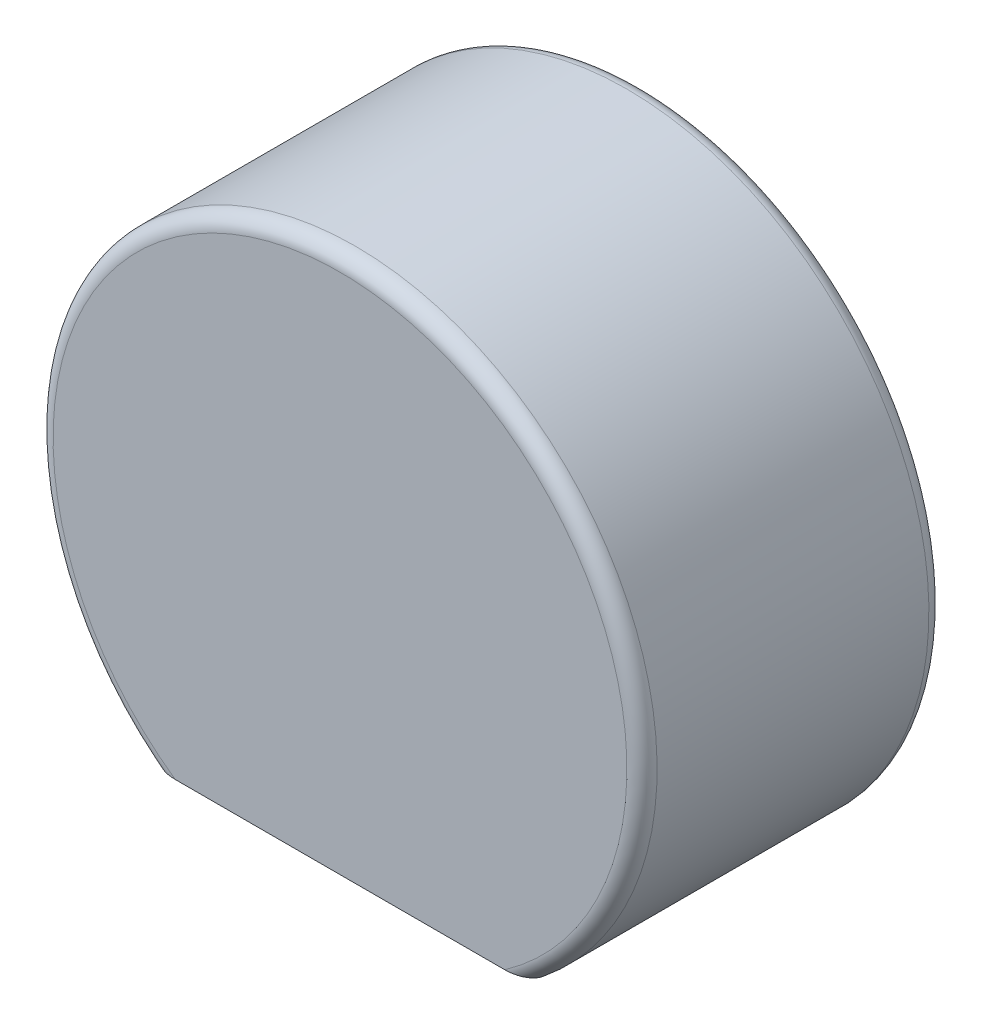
ISO-10303-21;
HEADER;
FILE_DESCRIPTION(('STEP AP214'),'2;1');
FILE_NAME('part.step','',(''),(''),'','','');
FILE_SCHEMA(('AUTOMOTIVE_DESIGN { 1 0 10303 214 1 1 1 1 }'));
ENDSEC;
DATA;
#1=APPLICATION_CONTEXT('core data for automotive mechanical design processes');
#2=APPLICATION_PROTOCOL_DEFINITION('international standard','automotive_design',2000,#1);
#3=PRODUCT_CONTEXT('',#1,'mechanical');
#4=PRODUCT('Part','Part','',(#3));
#5=PRODUCT_RELATED_PRODUCT_CATEGORY('part','',(#4));
#6=PRODUCT_DEFINITION_FORMATION('','',#4);
#7=PRODUCT_DEFINITION_CONTEXT('part definition',#1,'design');
#8=PRODUCT_DEFINITION('design','',#6,#7);
#9=PRODUCT_DEFINITION_SHAPE('','',#8);
#10=(LENGTH_UNIT() NAMED_UNIT(*) SI_UNIT(.MILLI.,.METRE.));
#11=(NAMED_UNIT(*) PLANE_ANGLE_UNIT() SI_UNIT($,.RADIAN.));
#12=(NAMED_UNIT(*) SI_UNIT($,.STERADIAN.) SOLID_ANGLE_UNIT());
#13=UNCERTAINTY_MEASURE_WITH_UNIT(LENGTH_MEASURE(1.E-05),#10,'distance_accuracy_value','');
#14=(GEOMETRIC_REPRESENTATION_CONTEXT(3) GLOBAL_UNCERTAINTY_ASSIGNED_CONTEXT((#13)) GLOBAL_UNIT_ASSIGNED_CONTEXT((#10,
#11,#12)) REPRESENTATION_CONTEXT('',''));
#15=CARTESIAN_POINT('',(0.,0.,0.));
#16=DIRECTION('',(0.,0.,1.));
#17=DIRECTION('',(1.,0.,0.));
#18=AXIS2_PLACEMENT_3D('',#15,#16,#17);
#19=CARTESIAN_POINT('',(0.,0.,20.));
#20=DIRECTION('',(0.,0.,-1.));
#21=DIRECTION('',(-1.,0.,0.));
#22=AXIS2_PLACEMENT_3D('',#19,#20,#21);
#23=CYLINDRICAL_SURFACE('',#22,20.);
#24=DIRECTION('',(0.,0.,-1.));
#25=VECTOR('',#24,1.);
#26=CARTESIAN_POINT('',(12.5707872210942,-15.5555555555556,20.));
#27=LINE('',#26,#25);
#28=CARTESIAN_POINT('',(12.5707872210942,-15.5555555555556,19.));
#29=VERTEX_POINT('',#28);
#30=CARTESIAN_POINT('',(12.5707872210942,-15.5555555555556,1.));
#31=VERTEX_POINT('',#30);
#32=EDGE_CURVE('E96',#29,#31,#27,.T.);
#33=ORIENTED_EDGE('',*,*,#32,.T.);
#34=CARTESIAN_POINT('',(0.,0.,1.));
#35=DIRECTION('',(0.,0.,1.));
#36=DIRECTION('',(1.,0.,0.));
#37=AXIS2_PLACEMENT_3D('',#34,#35,#36);
#38=CIRCLE('',#37,20.);
#39=CARTESIAN_POINT('',(-12.5707872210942,-15.5555555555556,1.));
#40=VERTEX_POINT('',#39);
#41=EDGE_CURVE('E94',#31,#40,#38,.T.);
#42=ORIENTED_EDGE('',*,*,#41,.T.);
#43=DIRECTION('',(0.,0.,-1.));
#44=VECTOR('',#43,1.);
#45=CARTESIAN_POINT('',(-12.5707872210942,-15.5555555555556,20.));
#46=LINE('',#45,#44);
#47=CARTESIAN_POINT('',(-12.5707872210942,-15.5555555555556,19.));
#48=VERTEX_POINT('',#47);
#49=EDGE_CURVE('E84',#48,#40,#46,.T.);
#50=ORIENTED_EDGE('',*,*,#49,.F.);
#51=CARTESIAN_POINT('',(0.,0.,19.));
#52=DIRECTION('',(0.,0.,1.));
#53=DIRECTION('',(1.,0.,0.));
#54=AXIS2_PLACEMENT_3D('',#51,#52,#53);
#55=CIRCLE('',#54,20.);
#56=EDGE_CURVE('E92',#48,#29,#55,.F.);
#57=ORIENTED_EDGE('',*,*,#56,.T.);
#58=EDGE_LOOP('',(#33,#42,#50,#57));
#59=FACE_BOUND('',#58,.T.);
#60=ADVANCED_FACE('F39',(#59),#23,.T.);
#61=CARTESIAN_POINT('',(-12.5707872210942,-15.5555555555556,20.));
#62=DIRECTION('',(0.,1.,0.));
#63=DIRECTION('',(0.,0.,1.));
#64=AXIS2_PLACEMENT_3D('',#61,#62,#63);
#65=PLANE('',#64);
#66=ORIENTED_EDGE('',*,*,#49,.T.);
#67=CARTESIAN_POINT('',(-12.5707872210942,-15.5555555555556,1.));
#68=CARTESIAN_POINT('',(-12.5707926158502,-15.5555555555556,0.979078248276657));
#69=CARTESIAN_POINT('',(-12.5697416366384,-15.5555555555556,0.958170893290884));
#70=CARTESIAN_POINT('',(-12.5655868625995,-15.5555555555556,0.916582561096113));
#71=CARTESIAN_POINT('',(-12.5624852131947,-15.5555555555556,0.89590137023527));
#72=CARTESIAN_POINT('',(-12.5502839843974,-15.5555555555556,0.834894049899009));
#73=CARTESIAN_POINT('',(-12.5382850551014,-15.5555555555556,0.795120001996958));
#74=CARTESIAN_POINT('',(-12.5076434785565,-15.5555555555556,0.718478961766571));
#75=CARTESIAN_POINT('',(-12.4890263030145,-15.5555555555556,0.681601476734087));
#76=CARTESIAN_POINT('',(-12.4463729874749,-15.5555555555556,0.611039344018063));
#77=CARTESIAN_POINT('',(-12.4223215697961,-15.5555555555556,0.577364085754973));
#78=CARTESIAN_POINT('',(-12.3571153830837,-15.5555555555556,0.497734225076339));
#79=CARTESIAN_POINT('',(-12.313372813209,-15.5555555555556,0.453905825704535));
#80=CARTESIAN_POINT('',(-12.2196095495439,-15.5555555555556,0.373653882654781));
#81=CARTESIAN_POINT('',(-12.169577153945,-15.5555555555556,0.337244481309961));
#82=CARTESIAN_POINT('',(-12.0360932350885,-15.5555555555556,0.252565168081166));
#83=CARTESIAN_POINT('',(-11.9496241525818,-15.5555555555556,0.209080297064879));
#84=CARTESIAN_POINT('',(-11.77096505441,-15.5555555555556,0.135606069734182));
#85=CARTESIAN_POINT('',(-11.6787527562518,-15.5555555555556,0.105673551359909));
#86=CARTESIAN_POINT('',(-11.5296946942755,-15.5555555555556,0.0673312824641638));
#87=CARTESIAN_POINT('',(-11.473781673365,-15.5555555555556,0.055123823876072));
#88=CARTESIAN_POINT('',(-11.361238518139,-15.5555555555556,0.0344879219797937));
#89=CARTESIAN_POINT('',(-11.3046081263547,-15.5555555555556,0.0260608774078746));
#90=CARTESIAN_POINT('',(-11.1916824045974,-15.5555555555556,0.012831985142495));
#91=CARTESIAN_POINT('',(-11.1353923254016,-15.5555555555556,0.00798432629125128));
#92=CARTESIAN_POINT('',(-11.0226796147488,-15.5555555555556,0.00157460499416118));
#93=CARTESIAN_POINT('',(-10.9662571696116,-15.5555555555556,9.29559272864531E-06));
#94=CARTESIAN_POINT('',(-10.9098437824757,-15.5555555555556,0.));
#95=B_SPLINE_CURVE_WITH_KNOTS('',3,(#67,#68,#69,#70,#71,#72,#73,#74,#75,#76,#77,#78,#79,#80,#81,
#82,#83,#84,#85,#86,#87,#88,#89,#90,#91,#92,#93,#94),.UNSPECIFIED.,.F.,.F.,(4,2,2,2,2,2,2,2,2,2,
2,2,2,4),(0.,0.0627120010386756,0.125358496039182,0.249223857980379,0.372617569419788,
0.496362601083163,0.681085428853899,0.86615715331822,1.15492622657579,1.44489541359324,
1.61646808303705,1.78810418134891,1.95750357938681,2.12673532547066),.UNSPECIFIED.);
#96=CARTESIAN_POINT('',(-10.9098437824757,-15.5555555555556,0.));
#97=VERTEX_POINT('',#96);
#98=EDGE_CURVE('E131',#40,#97,#95,.T.);
#99=ORIENTED_EDGE('',*,*,#98,.T.);
#100=DIRECTION('',(1.,0.,0.));
#101=VECTOR('',#100,1.);
#102=CARTESIAN_POINT('',(-12.5707872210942,-15.5555555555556,0.));
#103=LINE('',#102,#101);
#104=CARTESIAN_POINT('',(10.9098437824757,-15.5555555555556,0.));
#105=VERTEX_POINT('',#104);
#106=EDGE_CURVE('E185',#97,#105,#103,.T.);
#107=ORIENTED_EDGE('',*,*,#106,.T.);
#108=CARTESIAN_POINT('',(10.9098437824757,-15.5555555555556,0.));
#109=CARTESIAN_POINT('',(10.9886129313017,-15.5555555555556,3.68574071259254E-05));
#110=CARTESIAN_POINT('',(11.0674309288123,-15.5555555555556,0.00307258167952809));
#111=CARTESIAN_POINT('',(11.2248978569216,-15.5555555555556,0.0156951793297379));
#112=CARTESIAN_POINT('',(11.3035443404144,-15.5555555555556,0.0253121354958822));
#113=CARTESIAN_POINT('',(11.4604832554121,-15.5555555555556,0.0517982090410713));
#114=CARTESIAN_POINT('',(11.5387633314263,-15.5555555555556,0.0687422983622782));
#115=CARTESIAN_POINT('',(11.6929999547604,-15.5555555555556,0.110718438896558));
#116=CARTESIAN_POINT('',(11.7689611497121,-15.5555555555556,0.135732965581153));
#117=CARTESIAN_POINT('',(11.9047058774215,-15.5555555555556,0.190000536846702));
#118=CARTESIAN_POINT('',(11.9650550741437,-15.5555555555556,0.217824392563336));
#119=CARTESIAN_POINT('',(12.0819167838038,-15.5555555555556,0.280714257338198));
#120=CARTESIAN_POINT('',(12.1384303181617,-15.5555555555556,0.315778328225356));
#121=CARTESIAN_POINT('',(12.2464099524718,-15.5555555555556,0.394671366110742));
#122=CARTESIAN_POINT('',(12.2977871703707,-15.5555555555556,0.438624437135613));
#123=CARTESIAN_POINT('',(12.3910082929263,-15.5555555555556,0.535701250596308));
#124=CARTESIAN_POINT('',(12.4328925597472,-15.5555555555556,0.588784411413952));
#125=CARTESIAN_POINT('',(12.4876151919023,-15.5555555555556,0.679240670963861));
#126=CARTESIAN_POINT('',(12.5052388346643,-15.5555555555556,0.713729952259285));
#127=CARTESIAN_POINT('',(12.5346803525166,-15.5555555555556,0.785079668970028));
#128=CARTESIAN_POINT('',(12.5465113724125,-15.5555555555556,0.82193451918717));
#129=CARTESIAN_POINT('',(12.560204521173,-15.5555555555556,0.882534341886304));
#130=CARTESIAN_POINT('',(12.5641532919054,-15.5555555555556,0.905821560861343));
#131=CARTESIAN_POINT('',(12.5694527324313,-15.5555555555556,0.952732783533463));
#132=CARTESIAN_POINT('',(12.5707985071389,-15.5555555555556,0.976357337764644));
#133=CARTESIAN_POINT('',(12.5707872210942,-15.5555555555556,1.));
#134=B_SPLINE_CURVE_WITH_KNOTS('',3,(#108,#109,#110,#111,#112,#113,#114,#115,#116,#117,#118,
#119,#120,#121,#122,#123,#124,#125,#126,#127,#128,#129,#130,#131,#132,#133),.UNSPECIFIED.,.F.,
.F.,(4,2,2,2,2,2,2,2,2,2,2,2,4),(0.,0.236325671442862,0.473738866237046,0.713641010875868,
0.953025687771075,1.15198379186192,1.35088870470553,1.55279060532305,1.75381724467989,
1.86959620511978,1.9851112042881,2.05583541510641,2.12669249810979),.UNSPECIFIED.);
#135=EDGE_CURVE('E87',#105,#31,#134,.T.);
#136=ORIENTED_EDGE('',*,*,#135,.T.);
#137=ORIENTED_EDGE('',*,*,#32,.F.);
#138=CARTESIAN_POINT('',(12.5707872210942,-15.5555555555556,19.));
#139=CARTESIAN_POINT('',(12.5707926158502,-15.5555555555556,19.0209217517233));
#140=CARTESIAN_POINT('',(12.5697416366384,-15.5555555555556,19.0418291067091));
#141=CARTESIAN_POINT('',(12.5655868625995,-15.5555555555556,19.0834174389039));
#142=CARTESIAN_POINT('',(12.5624852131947,-15.5555555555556,19.1040986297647));
#143=CARTESIAN_POINT('',(12.5502839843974,-15.5555555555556,19.165105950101));
#144=CARTESIAN_POINT('',(12.5382850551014,-15.5555555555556,19.204879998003));
#145=CARTESIAN_POINT('',(12.5076434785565,-15.5555555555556,19.2815210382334));
#146=CARTESIAN_POINT('',(12.4890263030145,-15.5555555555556,19.3183985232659));
#147=CARTESIAN_POINT('',(12.4463729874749,-15.5555555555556,19.3889606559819));
#148=CARTESIAN_POINT('',(12.4223215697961,-15.5555555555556,19.422635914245));
#149=CARTESIAN_POINT('',(12.3571153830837,-15.5555555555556,19.5022657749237));
#150=CARTESIAN_POINT('',(12.313372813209,-15.5555555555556,19.5460941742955));
#151=CARTESIAN_POINT('',(12.2196095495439,-15.5555555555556,19.6263461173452));
#152=CARTESIAN_POINT('',(12.169577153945,-15.5555555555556,19.66275551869));
#153=CARTESIAN_POINT('',(12.0360932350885,-15.5555555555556,19.7474348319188));
#154=CARTESIAN_POINT('',(11.9496241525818,-15.5555555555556,19.7909197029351));
#155=CARTESIAN_POINT('',(11.77096505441,-15.5555555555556,19.8643939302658));
#156=CARTESIAN_POINT('',(11.6787527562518,-15.5555555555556,19.8943264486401));
#157=CARTESIAN_POINT('',(11.5296946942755,-15.5555555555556,19.9326687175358));
#158=CARTESIAN_POINT('',(11.473781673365,-15.5555555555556,19.9448761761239));
#159=CARTESIAN_POINT('',(11.361238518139,-15.5555555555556,19.9655120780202));
#160=CARTESIAN_POINT('',(11.3046081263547,-15.5555555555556,19.9739391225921));
#161=CARTESIAN_POINT('',(11.1916824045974,-15.5555555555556,19.9871680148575));
#162=CARTESIAN_POINT('',(11.1353923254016,-15.5555555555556,19.9920156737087));
#163=CARTESIAN_POINT('',(11.0226796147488,-15.5555555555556,19.9984253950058));
#164=CARTESIAN_POINT('',(10.9662571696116,-15.5555555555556,19.9999907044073));
#165=CARTESIAN_POINT('',(10.9098437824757,-15.5555555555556,20.));
#166=B_SPLINE_CURVE_WITH_KNOTS('',3,(#138,#139,#140,#141,#142,#143,#144,#145,#146,#147,#148,
#149,#150,#151,#152,#153,#154,#155,#156,#157,#158,#159,#160,#161,#162,#163,#164,#165),
.UNSPECIFIED.,.F.,.F.,(4,2,2,2,2,2,2,2,2,2,2,2,2,4),(0.,0.0627120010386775,0.125358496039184,
0.249223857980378,0.372617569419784,0.496362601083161,0.681085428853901,0.866157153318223,
1.15492622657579,1.44489541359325,1.61646808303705,1.78810418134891,1.95750357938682,
2.12673532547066),.UNSPECIFIED.);
#167=CARTESIAN_POINT('',(10.9098437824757,-15.5555555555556,20.));
#168=VERTEX_POINT('',#167);
#169=EDGE_CURVE('E56',#29,#168,#166,.T.);
#170=ORIENTED_EDGE('',*,*,#169,.T.);
#171=DIRECTION('',(1.,0.,0.));
#172=VECTOR('',#171,1.);
#173=CARTESIAN_POINT('',(-12.5707872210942,-15.5555555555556,20.));
#174=LINE('',#173,#172);
#175=CARTESIAN_POINT('',(-10.9098437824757,-15.5555555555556,20.));
#176=VERTEX_POINT('',#175);
#177=EDGE_CURVE('E85',#176,#168,#174,.T.);
#178=ORIENTED_EDGE('',*,*,#177,.F.);
#179=CARTESIAN_POINT('',(-10.9098437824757,-15.5555555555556,20.));
#180=CARTESIAN_POINT('',(-10.9886129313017,-15.5555555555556,19.9999631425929));
#181=CARTESIAN_POINT('',(-11.0674309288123,-15.5555555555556,19.9969274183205));
#182=CARTESIAN_POINT('',(-11.2248978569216,-15.5555555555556,19.9843048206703));
#183=CARTESIAN_POINT('',(-11.3035443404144,-15.5555555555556,19.9746878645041));
#184=CARTESIAN_POINT('',(-11.4604832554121,-15.5555555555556,19.9482017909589));
#185=CARTESIAN_POINT('',(-11.5387633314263,-15.5555555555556,19.9312577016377));
#186=CARTESIAN_POINT('',(-11.6929999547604,-15.5555555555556,19.8892815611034));
#187=CARTESIAN_POINT('',(-11.7689611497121,-15.5555555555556,19.8642670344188));
#188=CARTESIAN_POINT('',(-11.9047058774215,-15.5555555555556,19.8099994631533));
#189=CARTESIAN_POINT('',(-11.9650550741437,-15.5555555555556,19.7821756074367));
#190=CARTESIAN_POINT('',(-12.0819167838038,-15.5555555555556,19.7192857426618));
#191=CARTESIAN_POINT('',(-12.1384303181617,-15.5555555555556,19.6842216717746));
#192=CARTESIAN_POINT('',(-12.2464099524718,-15.5555555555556,19.6053286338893));
#193=CARTESIAN_POINT('',(-12.2977871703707,-15.5555555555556,19.5613755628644));
#194=CARTESIAN_POINT('',(-12.3910082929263,-15.5555555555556,19.4642987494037));
#195=CARTESIAN_POINT('',(-12.4328925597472,-15.5555555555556,19.4112155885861));
#196=CARTESIAN_POINT('',(-12.4876151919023,-15.5555555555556,19.3207593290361));
#197=CARTESIAN_POINT('',(-12.5052388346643,-15.5555555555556,19.2862700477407));
#198=CARTESIAN_POINT('',(-12.5346803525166,-15.5555555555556,19.21492033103));
#199=CARTESIAN_POINT('',(-12.5465113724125,-15.5555555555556,19.1780654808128));
#200=CARTESIAN_POINT('',(-12.5602045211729,-15.5555555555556,19.1174656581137));
#201=CARTESIAN_POINT('',(-12.5641532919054,-15.5555555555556,19.0941784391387));
#202=CARTESIAN_POINT('',(-12.5694527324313,-15.5555555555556,19.0472672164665));
#203=CARTESIAN_POINT('',(-12.5707985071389,-15.5555555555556,19.0236426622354));
#204=CARTESIAN_POINT('',(-12.5707872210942,-15.5555555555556,19.));
#205=B_SPLINE_CURVE_WITH_KNOTS('',3,(#179,#180,#181,#182,#183,#184,#185,#186,#187,#188,#189,
#190,#191,#192,#193,#194,#195,#196,#197,#198,#199,#200,#201,#202,#203,#204),.UNSPECIFIED.,.F.,
.F.,(4,2,2,2,2,2,2,2,2,2,2,2,4),(0.,0.236325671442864,0.473738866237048,0.713641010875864,
0.953025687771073,1.15198379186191,1.35088870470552,1.55279060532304,1.75381724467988,
1.86959620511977,1.9851112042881,2.0558354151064,2.12669249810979),.UNSPECIFIED.);
#206=EDGE_CURVE('E64',#176,#48,#205,.T.);
#207=ORIENTED_EDGE('',*,*,#206,.T.);
#208=EDGE_LOOP('',(#66,#99,#107,#136,#137,#170,#178,#207));
#209=FACE_BOUND('',#208,.T.);
#210=ADVANCED_FACE('F83',(#209),#65,.F.);
#211=CARTESIAN_POINT('',(0.,0.,20.));
#212=DIRECTION('',(0.,0.,1.));
#213=DIRECTION('',(1.,0.,0.));
#214=AXIS2_PLACEMENT_3D('',#211,#212,#213);
#215=PLANE('',#214);
#216=ORIENTED_EDGE('',*,*,#177,.T.);
#217=CARTESIAN_POINT('',(0.,0.,20.));
#218=DIRECTION('',(0.,0.,1.));
#219=DIRECTION('',(1.,0.,0.));
#220=AXIS2_PLACEMENT_3D('',#217,#218,#219);
#221=CIRCLE('',#220,19.);
#222=EDGE_CURVE('E11',#168,#176,#221,.T.);
#223=ORIENTED_EDGE('',*,*,#222,.T.);
#224=EDGE_LOOP('',(#216,#223));
#225=FACE_BOUND('',#224,.T.);
#226=ADVANCED_FACE('F119',(#225),#215,.T.);
#227=CARTESIAN_POINT('',(0.,0.,0.));
#228=DIRECTION('',(0.,0.,1.));
#229=DIRECTION('',(1.,0.,0.));
#230=AXIS2_PLACEMENT_3D('',#227,#228,#229);
#231=PLANE('',#230);
#232=ORIENTED_EDGE('',*,*,#106,.F.);
#233=CARTESIAN_POINT('',(0.,0.,0.));
#234=DIRECTION('',(0.,0.,1.));
#235=DIRECTION('',(1.,0.,0.));
#236=AXIS2_PLACEMENT_3D('',#233,#234,#235);
#237=CIRCLE('',#236,19.);
#238=EDGE_CURVE('E49',#97,#105,#237,.F.);
#239=ORIENTED_EDGE('',*,*,#238,.T.);
#240=EDGE_LOOP('',(#232,#239));
#241=FACE_BOUND('',#240,.T.);
#242=ADVANCED_FACE('F120',(#241),#231,.F.);
#243=CARTESIAN_POINT('',(0.,0.,1.));
#244=DIRECTION('',(0.,0.,1.));
#245=DIRECTION('',(1.,0.,0.));
#246=AXIS2_PLACEMENT_3D('',#243,#244,#245);
#247=TOROIDAL_SURFACE('',#246,19.,1.);
#248=ORIENTED_EDGE('',*,*,#135,.F.);
#249=ORIENTED_EDGE('',*,*,#238,.F.);
#250=ORIENTED_EDGE('',*,*,#98,.F.);
#251=ORIENTED_EDGE('',*,*,#41,.F.);
#252=EDGE_LOOP('',(#248,#249,#250,#251));
#253=FACE_BOUND('',#252,.T.);
#254=ADVANCED_FACE('F136',(#253),#247,.T.);
#255=CARTESIAN_POINT('',(0.,0.,19.));
#256=DIRECTION('',(0.,0.,1.));
#257=DIRECTION('',(1.,0.,0.));
#258=AXIS2_PLACEMENT_3D('',#255,#256,#257);
#259=TOROIDAL_SURFACE('',#258,19.,1.);
#260=ORIENTED_EDGE('',*,*,#169,.F.);
#261=ORIENTED_EDGE('',*,*,#56,.F.);
#262=ORIENTED_EDGE('',*,*,#206,.F.);
#263=ORIENTED_EDGE('',*,*,#222,.F.);
#264=EDGE_LOOP('',(#260,#261,#262,#263));
#265=FACE_BOUND('',#264,.T.);
#266=ADVANCED_FACE('F41',(#265),#259,.T.);
#267=CLOSED_SHELL('',(#60,#210,#226,#242,#254,#266));
#268=MANIFOLD_SOLID_BREP('B2',#267);
#269=ADVANCED_BREP_SHAPE_REPRESENTATION('',(#18,#268),#14);
#270=SHAPE_DEFINITION_REPRESENTATION(#9,#269);
ENDSEC;
END-ISO-10303-21;
